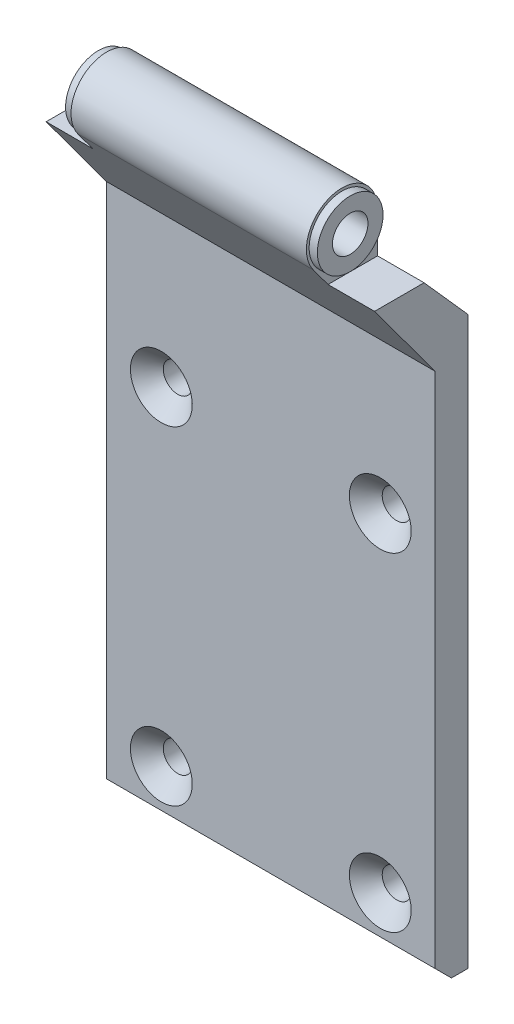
ISO-10303-21;
HEADER;
FILE_DESCRIPTION(('STEP AP214'),'2;1');
FILE_NAME('part.step','',(''),(''),'','','');
FILE_SCHEMA(('AUTOMOTIVE_DESIGN { 1 0 10303 214 1 1 1 1 }'));
ENDSEC;
DATA;
#1=APPLICATION_CONTEXT('core data for automotive mechanical design processes');
#2=APPLICATION_PROTOCOL_DEFINITION('international standard','automotive_design',2000,#1);
#3=PRODUCT_CONTEXT('',#1,'mechanical');
#4=PRODUCT('Part','Part','',(#3));
#5=PRODUCT_RELATED_PRODUCT_CATEGORY('part','',(#4));
#6=PRODUCT_DEFINITION_FORMATION('','',#4);
#7=PRODUCT_DEFINITION_CONTEXT('part definition',#1,'design');
#8=PRODUCT_DEFINITION('design','',#6,#7);
#9=PRODUCT_DEFINITION_SHAPE('','',#8);
#10=(LENGTH_UNIT() NAMED_UNIT(*) SI_UNIT(.MILLI.,.METRE.));
#11=(NAMED_UNIT(*) PLANE_ANGLE_UNIT() SI_UNIT($,.RADIAN.));
#12=(NAMED_UNIT(*) SI_UNIT($,.STERADIAN.) SOLID_ANGLE_UNIT());
#13=UNCERTAINTY_MEASURE_WITH_UNIT(LENGTH_MEASURE(1.E-05),#10,'distance_accuracy_value','');
#14=(GEOMETRIC_REPRESENTATION_CONTEXT(3) GLOBAL_UNCERTAINTY_ASSIGNED_CONTEXT((#13)) GLOBAL_UNIT_ASSIGNED_CONTEXT((#10,
#11,#12)) REPRESENTATION_CONTEXT('',''));
#15=CARTESIAN_POINT('',(0.,0.,0.));
#16=DIRECTION('',(0.,0.,1.));
#17=DIRECTION('',(1.,0.,0.));
#18=AXIS2_PLACEMENT_3D('',#15,#16,#17);
#19=CARTESIAN_POINT('',(41.5,102.5,21.));
#20=DIRECTION('',(-1.,0.,0.));
#21=DIRECTION('',(0.,-1.,0.));
#22=AXIS2_PLACEMENT_3D('',#19,#20,#21);
#23=PLANE('',#22);
#24=CARTESIAN_POINT('',(41.5,110.,14.5));
#25=DIRECTION('',(-1.,0.,0.));
#26=DIRECTION('',(0.,-1.,0.));
#27=AXIS2_PLACEMENT_3D('',#24,#25,#26);
#28=CIRCLE('',#27,6.5);
#29=CARTESIAN_POINT('',(41.5,106.145111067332,19.7335295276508));
#30=VERTEX_POINT('',#29);
#31=CARTESIAN_POINT('',(41.5,110.,8.));
#32=VERTEX_POINT('',#31);
#33=EDGE_CURVE('E293',#30,#32,#28,.T.);
#34=ORIENTED_EDGE('',*,*,#33,.F.);
#35=DIRECTION('',(0.,0.805158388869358,0.593059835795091));
#36=VECTOR('',#35,1.);
#37=CARTESIAN_POINT('',(41.5,87.5,6.));
#38=LINE('',#37,#36);
#39=CARTESIAN_POINT('',(41.5,102.5,17.0486305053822));
#40=VERTEX_POINT('',#39);
#41=EDGE_CURVE('E177',#40,#30,#38,.T.);
#42=ORIENTED_EDGE('',*,*,#41,.F.);
#43=DIRECTION('',(0.,0.,-1.));
#44=VECTOR('',#43,1.);
#45=CARTESIAN_POINT('',(41.5,102.5,21.));
#46=LINE('',#45,#44);
#47=CARTESIAN_POINT('',(41.5,102.5,8.));
#48=VERTEX_POINT('',#47);
#49=EDGE_CURVE('E107',#40,#48,#46,.T.);
#50=ORIENTED_EDGE('',*,*,#49,.T.);
#51=DIRECTION('',(0.,1.,0.));
#52=VECTOR('',#51,1.);
#53=CARTESIAN_POINT('',(41.5,102.5,8.));
#54=LINE('',#53,#52);
#55=EDGE_CURVE('E108',#48,#32,#54,.T.);
#56=ORIENTED_EDGE('',*,*,#55,.T.);
#57=EDGE_LOOP('',(#34,#42,#50,#56));
#58=FACE_BOUND('',#57,.T.);
#59=CARTESIAN_POINT('',(41.5,110.,14.5));
#60=DIRECTION('',(-1.,0.,0.));
#61=DIRECTION('',(0.,-1.,0.));
#62=AXIS2_PLACEMENT_3D('',#59,#60,#61);
#63=CIRCLE('',#62,6.);
#64=CARTESIAN_POINT('',(41.5,104.,14.5));
#65=VERTEX_POINT('',#64);
#66=EDGE_CURVE('E183',#65,#65,#63,.F.);
#67=ORIENTED_EDGE('',*,*,#66,.F.);
#68=EDGE_LOOP('',(#67));
#69=FACE_BOUND('',#68,.T.);
#70=ADVANCED_FACE('F14',(#58,#69),#23,.F.);
#71=CARTESIAN_POINT('',(-1.5,116.5,21.));
#72=DIRECTION('',(1.,0.,0.));
#73=DIRECTION('',(0.,1.,0.));
#74=AXIS2_PLACEMENT_3D('',#71,#72,#73);
#75=PLANE('',#74);
#76=DIRECTION('',(0.,-1.,0.));
#77=VECTOR('',#76,1.);
#78=CARTESIAN_POINT('',(-1.5,116.5,8.));
#79=LINE('',#78,#77);
#80=CARTESIAN_POINT('',(-1.5,110.,8.));
#81=VERTEX_POINT('',#80);
#82=CARTESIAN_POINT('',(-1.5,102.5,8.));
#83=VERTEX_POINT('',#82);
#84=EDGE_CURVE('E291',#81,#83,#79,.T.);
#85=ORIENTED_EDGE('',*,*,#84,.T.);
#86=DIRECTION('',(0.,0.,-1.));
#87=VECTOR('',#86,1.);
#88=CARTESIAN_POINT('',(-1.5,102.5,21.));
#89=LINE('',#88,#87);
#90=CARTESIAN_POINT('',(-1.5,102.5,17.0486305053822));
#91=VERTEX_POINT('',#90);
#92=EDGE_CURVE('E305',#91,#83,#89,.T.);
#93=ORIENTED_EDGE('',*,*,#92,.F.);
#94=DIRECTION('',(0.,-0.805158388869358,-0.593059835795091));
#95=VECTOR('',#94,1.);
#96=CARTESIAN_POINT('',(-1.5,87.5,6.));
#97=LINE('',#96,#95);
#98=CARTESIAN_POINT('',(-1.5,106.145111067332,19.7335295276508));
#99=VERTEX_POINT('',#98);
#100=EDGE_CURVE('E174',#99,#91,#97,.T.);
#101=ORIENTED_EDGE('',*,*,#100,.F.);
#102=CARTESIAN_POINT('',(-1.5,110.,14.5));
#103=DIRECTION('',(1.,0.,0.));
#104=DIRECTION('',(0.,1.,0.));
#105=AXIS2_PLACEMENT_3D('',#102,#103,#104);
#106=CIRCLE('',#105,6.5);
#107=EDGE_CURVE('E125',#81,#99,#106,.T.);
#108=ORIENTED_EDGE('',*,*,#107,.F.);
#109=EDGE_LOOP('',(#85,#93,#101,#108));
#110=FACE_BOUND('',#109,.T.);
#111=CARTESIAN_POINT('',(-1.5,110.,14.5));
#112=DIRECTION('',(1.,0.,0.));
#113=DIRECTION('',(0.,1.,0.));
#114=AXIS2_PLACEMENT_3D('',#111,#112,#113);
#115=CIRCLE('',#114,6.);
#116=CARTESIAN_POINT('',(-1.5,116.,14.5));
#117=VERTEX_POINT('',#116);
#118=EDGE_CURVE('E180',#117,#117,#115,.F.);
#119=ORIENTED_EDGE('',*,*,#118,.F.);
#120=EDGE_LOOP('',(#119));
#121=FACE_BOUND('',#120,.T.);
#122=ADVANCED_FACE('F233',(#110,#121),#75,.F.);
#123=CARTESIAN_POINT('',(-10.,110.,14.5));
#124=DIRECTION('',(1.,0.,0.));
#125=DIRECTION('',(0.,1.,0.));
#126=AXIS2_PLACEMENT_3D('',#123,#124,#125);
#127=CYLINDRICAL_SURFACE('',#126,6.5);
#128=DIRECTION('',(1.,0.,0.));
#129=VECTOR('',#128,1.);
#130=CARTESIAN_POINT('',(-10.,106.145111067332,19.7335295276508));
#131=LINE('',#130,#129);
#132=EDGE_CURVE('E151',#99,#30,#131,.T.);
#133=ORIENTED_EDGE('',*,*,#132,.T.);
#134=ORIENTED_EDGE('',*,*,#33,.T.);
#135=DIRECTION('',(1.,0.,0.));
#136=VECTOR('',#135,1.);
#137=CARTESIAN_POINT('',(-10.,110.,8.));
#138=LINE('',#137,#136);
#139=EDGE_CURVE('E163',#81,#32,#138,.T.);
#140=ORIENTED_EDGE('',*,*,#139,.F.);
#141=ORIENTED_EDGE('',*,*,#107,.T.);
#142=EDGE_LOOP('',(#133,#134,#140,#141));
#143=FACE_BOUND('',#142,.T.);
#144=ADVANCED_FACE('F240',(#143),#127,.T.);
#145=CARTESIAN_POINT('',(-10.,110.,8.));
#146=DIRECTION('',(0.,0.,1.));
#147=DIRECTION('',(0.,1.,0.));
#148=AXIS2_PLACEMENT_3D('',#145,#146,#147);
#149=PLANE('',#148);
#150=ORIENTED_EDGE('',*,*,#139,.T.);
#151=ORIENTED_EDGE('',*,*,#55,.F.);
#152=DIRECTION('',(1.,0.,0.));
#153=VECTOR('',#152,1.);
#154=CARTESIAN_POINT('',(-10.,102.5,8.));
#155=LINE('',#154,#153);
#156=EDGE_CURVE('E118',#83,#48,#155,.T.);
#157=ORIENTED_EDGE('',*,*,#156,.F.);
#158=ORIENTED_EDGE('',*,*,#84,.F.);
#159=EDGE_LOOP('',(#150,#151,#157,#158));
#160=FACE_BOUND('',#159,.T.);
#161=ADVANCED_FACE('F16',(#160),#149,.F.);
#162=CARTESIAN_POINT('',(-10.,102.5,8.));
#163=DIRECTION('',(0.,-0.66436383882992,0.74740931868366));
#164=DIRECTION('',(0.,0.74740931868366,0.66436383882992));
#165=AXIS2_PLACEMENT_3D('',#162,#163,#164);
#166=PLANE('',#165);
#167=DIRECTION('',(1.,0.,0.));
#168=VECTOR('',#167,1.);
#169=CARTESIAN_POINT('',(-10.,93.5,0.));
#170=LINE('',#169,#168);
#171=CARTESIAN_POINT('',(-10.,93.5,0.));
#172=VERTEX_POINT('',#171);
#173=CARTESIAN_POINT('',(50.,93.5,0.));
#174=VERTEX_POINT('',#173);
#175=EDGE_CURVE('E159',#172,#174,#170,.T.);
#176=ORIENTED_EDGE('',*,*,#175,.F.);
#177=DIRECTION('',(0.,-0.74740931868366,-0.66436383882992));
#178=VECTOR('',#177,1.);
#179=CARTESIAN_POINT('',(-10.,102.5,8.));
#180=LINE('',#179,#178);
#181=CARTESIAN_POINT('',(-10.,102.5,8.));
#182=VERTEX_POINT('',#181);
#183=EDGE_CURVE('E138',#182,#172,#180,.T.);
#184=ORIENTED_EDGE('',*,*,#183,.F.);
#185=EDGE_CURVE('E161',#182,#83,#155,.T.);
#186=ORIENTED_EDGE('',*,*,#185,.T.);
#187=ORIENTED_EDGE('',*,*,#156,.T.);
#188=DIRECTION('',(-1.,0.,0.));
#189=VECTOR('',#188,1.);
#190=CARTESIAN_POINT('',(50.,102.5,8.));
#191=LINE('',#190,#189);
#192=CARTESIAN_POINT('',(50.,102.5,8.));
#193=VERTEX_POINT('',#192);
#194=EDGE_CURVE('E101',#193,#48,#191,.T.);
#195=ORIENTED_EDGE('',*,*,#194,.F.);
#196=DIRECTION('',(0.,-0.74740931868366,-0.66436383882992));
#197=VECTOR('',#196,1.);
#198=CARTESIAN_POINT('',(50.,102.5,8.));
#199=LINE('',#198,#197);
#200=EDGE_CURVE('E114',#193,#174,#199,.T.);
#201=ORIENTED_EDGE('',*,*,#200,.T.);
#202=EDGE_LOOP('',(#176,#184,#186,#187,#195,#201));
#203=FACE_BOUND('',#202,.T.);
#204=ADVANCED_FACE('F113',(#203),#166,.F.);
#205=CARTESIAN_POINT('',(-10.,93.5,0.));
#206=DIRECTION('',(0.,0.,1.));
#207=DIRECTION('',(-1.,0.,0.));
#208=AXIS2_PLACEMENT_3D('',#205,#206,#207);
#209=PLANE('',#208);
#210=CARTESIAN_POINT('',(40.,60.,0.));
#211=DIRECTION('',(0.,0.,1.));
#212=DIRECTION('',(0.,1.,0.));
#213=AXIS2_PLACEMENT_3D('',#210,#211,#212);
#214=CIRCLE('',#213,2.65);
#215=CARTESIAN_POINT('',(40.,62.65,0.));
#216=VERTEX_POINT('',#215);
#217=EDGE_CURVE('E376',#216,#216,#214,.T.);
#218=ORIENTED_EDGE('',*,*,#217,.T.);
#219=EDGE_LOOP('',(#218));
#220=FACE_BOUND('',#219,.T.);
#221=CARTESIAN_POINT('',(40.,0.,0.));
#222=DIRECTION('',(0.,0.,1.));
#223=DIRECTION('',(0.,1.,0.));
#224=AXIS2_PLACEMENT_3D('',#221,#222,#223);
#225=CIRCLE('',#224,2.65);
#226=CARTESIAN_POINT('',(40.,2.65,0.));
#227=VERTEX_POINT('',#226);
#228=EDGE_CURVE('E377',#227,#227,#225,.T.);
#229=ORIENTED_EDGE('',*,*,#228,.T.);
#230=EDGE_LOOP('',(#229));
#231=FACE_BOUND('',#230,.T.);
#232=CARTESIAN_POINT('',(0.,60.,0.));
#233=DIRECTION('',(0.,0.,1.));
#234=DIRECTION('',(0.,1.,0.));
#235=AXIS2_PLACEMENT_3D('',#232,#233,#234);
#236=CIRCLE('',#235,2.65);
#237=CARTESIAN_POINT('',(0.,62.65,0.));
#238=VERTEX_POINT('',#237);
#239=EDGE_CURVE('E380',#238,#238,#236,.T.);
#240=ORIENTED_EDGE('',*,*,#239,.T.);
#241=EDGE_LOOP('',(#240));
#242=FACE_BOUND('',#241,.T.);
#243=CARTESIAN_POINT('',(0.,0.,0.));
#244=DIRECTION('',(0.,0.,1.));
#245=DIRECTION('',(0.,1.,0.));
#246=AXIS2_PLACEMENT_3D('',#243,#244,#245);
#247=CIRCLE('',#246,2.65);
#248=CARTESIAN_POINT('',(0.,2.65,0.));
#249=VERTEX_POINT('',#248);
#250=EDGE_CURVE('E385',#249,#249,#247,.T.);
#251=ORIENTED_EDGE('',*,*,#250,.T.);
#252=EDGE_LOOP('',(#251));
#253=FACE_BOUND('',#252,.T.);
#254=DIRECTION('',(1.,0.,0.));
#255=VECTOR('',#254,1.);
#256=CARTESIAN_POINT('',(-10.,-10.,0.));
#257=LINE('',#256,#255);
#258=CARTESIAN_POINT('',(-10.,-10.,0.));
#259=VERTEX_POINT('',#258);
#260=CARTESIAN_POINT('',(50.,-10.,0.));
#261=VERTEX_POINT('',#260);
#262=EDGE_CURVE('E157',#259,#261,#257,.T.);
#263=ORIENTED_EDGE('',*,*,#262,.F.);
#264=DIRECTION('',(0.,-1.,0.));
#265=VECTOR('',#264,1.);
#266=CARTESIAN_POINT('',(-10.,93.5,0.));
#267=LINE('',#266,#265);
#268=EDGE_CURVE('E141',#172,#259,#267,.T.);
#269=ORIENTED_EDGE('',*,*,#268,.F.);
#270=ORIENTED_EDGE('',*,*,#175,.T.);
#271=DIRECTION('',(0.,-1.,0.));
#272=VECTOR('',#271,1.);
#273=CARTESIAN_POINT('',(50.,93.5,0.));
#274=LINE('',#273,#272);
#275=EDGE_CURVE('E124',#174,#261,#274,.T.);
#276=ORIENTED_EDGE('',*,*,#275,.T.);
#277=EDGE_LOOP('',(#263,#269,#270,#276));
#278=FACE_BOUND('',#277,.T.);
#279=ADVANCED_FACE('F275',(#220,#231,#242,#253,#278),#209,.F.);
#280=CARTESIAN_POINT('',(-10.,-10.,0.));
#281=DIRECTION('',(0.,1.,0.));
#282=DIRECTION('',(-1.,0.,0.));
#283=AXIS2_PLACEMENT_3D('',#280,#281,#282);
#284=PLANE('',#283);
#285=DIRECTION('',(0.,0.,1.));
#286=VECTOR('',#285,1.);
#287=CARTESIAN_POINT('',(50.,-10.,0.));
#288=LINE('',#287,#286);
#289=CARTESIAN_POINT('',(50.,-10.,3.));
#290=VERTEX_POINT('',#289);
#291=EDGE_CURVE('E127',#261,#290,#288,.T.);
#292=ORIENTED_EDGE('',*,*,#291,.T.);
#293=DIRECTION('',(-1.,0.,0.));
#294=VECTOR('',#293,1.);
#295=CARTESIAN_POINT('',(-10.,-10.,3.));
#296=LINE('',#295,#294);
#297=CARTESIAN_POINT('',(-10.,-10.,3.));
#298=VERTEX_POINT('',#297);
#299=EDGE_CURVE('E37',#290,#298,#296,.T.);
#300=ORIENTED_EDGE('',*,*,#299,.T.);
#301=DIRECTION('',(0.,0.,1.));
#302=VECTOR('',#301,1.);
#303=CARTESIAN_POINT('',(-10.,-10.,0.));
#304=LINE('',#303,#302);
#305=EDGE_CURVE('E144',#259,#298,#304,.T.);
#306=ORIENTED_EDGE('',*,*,#305,.F.);
#307=ORIENTED_EDGE('',*,*,#262,.T.);
#308=EDGE_LOOP('',(#292,#300,#306,#307));
#309=FACE_BOUND('',#308,.T.);
#310=ADVANCED_FACE('F271',(#309),#284,.F.);
#311=CARTESIAN_POINT('',(-10.,-10.,6.));
#312=DIRECTION('',(0.,0.,-1.));
#313=DIRECTION('',(0.,-1.,0.));
#314=AXIS2_PLACEMENT_3D('',#311,#312,#313);
#315=PLANE('',#314);
#316=CARTESIAN_POINT('',(40.,60.,6.));
#317=DIRECTION('',(0.,0.,-1.));
#318=DIRECTION('',(0.,-1.,0.));
#319=AXIS2_PLACEMENT_3D('',#316,#317,#318);
#320=CIRCLE('',#319,5.65);
#321=CARTESIAN_POINT('',(40.,54.35,6.));
#322=VERTEX_POINT('',#321);
#323=EDGE_CURVE('E203',#322,#322,#320,.T.);
#324=ORIENTED_EDGE('',*,*,#323,.T.);
#325=EDGE_LOOP('',(#324));
#326=FACE_BOUND('',#325,.T.);
#327=CARTESIAN_POINT('',(0.,60.,6.));
#328=DIRECTION('',(0.,0.,-1.));
#329=DIRECTION('',(0.,-1.,0.));
#330=AXIS2_PLACEMENT_3D('',#327,#328,#329);
#331=CIRCLE('',#330,5.65);
#332=CARTESIAN_POINT('',(0.,54.35,6.));
#333=VERTEX_POINT('',#332);
#334=EDGE_CURVE('E200',#333,#333,#331,.T.);
#335=ORIENTED_EDGE('',*,*,#334,.T.);
#336=EDGE_LOOP('',(#335));
#337=FACE_BOUND('',#336,.T.);
#338=CARTESIAN_POINT('',(0.,0.,6.));
#339=DIRECTION('',(0.,0.,-1.));
#340=DIRECTION('',(0.,-1.,0.));
#341=AXIS2_PLACEMENT_3D('',#338,#339,#340);
#342=CIRCLE('',#341,5.65);
#343=CARTESIAN_POINT('',(0.,-5.65,6.));
#344=VERTEX_POINT('',#343);
#345=EDGE_CURVE('E197',#344,#344,#342,.T.);
#346=ORIENTED_EDGE('',*,*,#345,.T.);
#347=EDGE_LOOP('',(#346));
#348=FACE_BOUND('',#347,.T.);
#349=CARTESIAN_POINT('',(40.,0.,6.));
#350=DIRECTION('',(0.,0.,-1.));
#351=DIRECTION('',(0.,-1.,0.));
#352=AXIS2_PLACEMENT_3D('',#349,#350,#351);
#353=CIRCLE('',#352,5.65);
#354=CARTESIAN_POINT('',(40.,-5.65,6.));
#355=VERTEX_POINT('',#354);
#356=EDGE_CURVE('E194',#355,#355,#353,.T.);
#357=ORIENTED_EDGE('',*,*,#356,.T.);
#358=EDGE_LOOP('',(#357));
#359=FACE_BOUND('',#358,.T.);
#360=DIRECTION('',(0.,1.,0.));
#361=VECTOR('',#360,1.);
#362=CARTESIAN_POINT('',(-10.,-10.,6.));
#363=LINE('',#362,#361);
#364=CARTESIAN_POINT('',(-10.,-7.,6.));
#365=VERTEX_POINT('',#364);
#366=CARTESIAN_POINT('',(-10.,87.5,6.));
#367=VERTEX_POINT('',#366);
#368=EDGE_CURVE('E146',#365,#367,#363,.T.);
#369=ORIENTED_EDGE('',*,*,#368,.F.);
#370=DIRECTION('',(1.,0.,0.));
#371=VECTOR('',#370,1.);
#372=CARTESIAN_POINT('',(-10.,-7.,6.));
#373=LINE('',#372,#371);
#374=CARTESIAN_POINT('',(50.,-7.,6.));
#375=VERTEX_POINT('',#374);
#376=EDGE_CURVE('E166',#365,#375,#373,.T.);
#377=ORIENTED_EDGE('',*,*,#376,.T.);
#378=DIRECTION('',(0.,1.,0.));
#379=VECTOR('',#378,1.);
#380=CARTESIAN_POINT('',(50.,-10.,6.));
#381=LINE('',#380,#379);
#382=CARTESIAN_POINT('',(50.,87.5,6.));
#383=VERTEX_POINT('',#382);
#384=EDGE_CURVE('E134',#375,#383,#381,.T.);
#385=ORIENTED_EDGE('',*,*,#384,.T.);
#386=DIRECTION('',(1.,0.,0.));
#387=VECTOR('',#386,1.);
#388=CARTESIAN_POINT('',(-10.,87.5,6.));
#389=LINE('',#388,#387);
#390=EDGE_CURVE('E154',#367,#383,#389,.T.);
#391=ORIENTED_EDGE('',*,*,#390,.F.);
#392=EDGE_LOOP('',(#369,#377,#385,#391));
#393=FACE_BOUND('',#392,.T.);
#394=ADVANCED_FACE('F262',(#326,#337,#348,#359,#393),#315,.F.);
#395=CARTESIAN_POINT('',(-10.,87.5,6.));
#396=DIRECTION('',(0.,0.593059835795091,-0.805158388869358));
#397=DIRECTION('',(0.,-0.805158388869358,-0.593059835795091));
#398=AXIS2_PLACEMENT_3D('',#395,#396,#397);
#399=PLANE('',#398);
#400=DIRECTION('',(-1.,0.,0.));
#401=VECTOR('',#400,1.);
#402=CARTESIAN_POINT('',(-10.,102.5,17.0486305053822));
#403=LINE('',#402,#401);
#404=CARTESIAN_POINT('',(50.,102.5,17.0486305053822));
#405=VERTEX_POINT('',#404);
#406=EDGE_CURVE('E29',#405,#40,#403,.T.);
#407=ORIENTED_EDGE('',*,*,#406,.T.);
#408=ORIENTED_EDGE('',*,*,#41,.T.);
#409=ORIENTED_EDGE('',*,*,#132,.F.);
#410=ORIENTED_EDGE('',*,*,#100,.T.);
#411=DIRECTION('',(-1.,0.,0.));
#412=VECTOR('',#411,1.);
#413=CARTESIAN_POINT('',(-10.,102.5,17.0486305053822));
#414=LINE('',#413,#412);
#415=CARTESIAN_POINT('',(-10.,102.5,17.0486305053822));
#416=VERTEX_POINT('',#415);
#417=EDGE_CURVE('E129',#91,#416,#414,.T.);
#418=ORIENTED_EDGE('',*,*,#417,.T.);
#419=DIRECTION('',(0.,0.805158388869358,0.593059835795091));
#420=VECTOR('',#419,1.);
#421=CARTESIAN_POINT('',(-10.,87.5,6.));
#422=LINE('',#421,#420);
#423=EDGE_CURVE('E148',#367,#416,#422,.T.);
#424=ORIENTED_EDGE('',*,*,#423,.F.);
#425=ORIENTED_EDGE('',*,*,#390,.T.);
#426=DIRECTION('',(0.,0.805158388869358,0.593059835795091));
#427=VECTOR('',#426,1.);
#428=CARTESIAN_POINT('',(50.,87.5,6.));
#429=LINE('',#428,#427);
#430=EDGE_CURVE('E136',#383,#405,#429,.T.);
#431=ORIENTED_EDGE('',*,*,#430,.T.);
#432=EDGE_LOOP('',(#407,#408,#409,#410,#418,#424,#425,#431));
#433=FACE_BOUND('',#432,.T.);
#434=ADVANCED_FACE('F258',(#433),#399,.F.);
#435=CARTESIAN_POINT('',(-10.,110.,14.5));
#436=DIRECTION('',(-1.,0.,0.));
#437=DIRECTION('',(0.,-1.,0.));
#438=AXIS2_PLACEMENT_3D('',#435,#436,#437);
#439=PLANE('',#438);
#440=DIRECTION('',(0.,0.,-1.));
#441=VECTOR('',#440,1.);
#442=CARTESIAN_POINT('',(-10.,102.5,21.));
#443=LINE('',#442,#441);
#444=EDGE_CURVE('E302',#416,#182,#443,.T.);
#445=ORIENTED_EDGE('',*,*,#444,.T.);
#446=ORIENTED_EDGE('',*,*,#183,.T.);
#447=ORIENTED_EDGE('',*,*,#268,.T.);
#448=ORIENTED_EDGE('',*,*,#305,.T.);
#449=DIRECTION('',(0.,-0.707106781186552,-0.707106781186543));
#450=VECTOR('',#449,1.);
#451=CARTESIAN_POINT('',(-10.,55.7500000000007,68.75));
#452=LINE('',#451,#450);
#453=EDGE_CURVE('E172',#298,#365,#452,.F.);
#454=ORIENTED_EDGE('',*,*,#453,.T.);
#455=ORIENTED_EDGE('',*,*,#368,.T.);
#456=ORIENTED_EDGE('',*,*,#423,.T.);
#457=EDGE_LOOP('',(#445,#446,#447,#448,#454,#455,#456));
#458=FACE_BOUND('',#457,.T.);
#459=ADVANCED_FACE('F257',(#458),#439,.T.);
#460=CARTESIAN_POINT('',(50.,110.,14.5));
#461=DIRECTION('',(-1.,0.,0.));
#462=DIRECTION('',(0.,-1.,0.));
#463=AXIS2_PLACEMENT_3D('',#460,#461,#462);
#464=PLANE('',#463);
#465=ORIENTED_EDGE('',*,*,#200,.F.);
#466=DIRECTION('',(0.,0.,-1.));
#467=VECTOR('',#466,1.);
#468=CARTESIAN_POINT('',(50.,102.5,21.));
#469=LINE('',#468,#467);
#470=EDGE_CURVE('E98',#405,#193,#469,.T.);
#471=ORIENTED_EDGE('',*,*,#470,.F.);
#472=ORIENTED_EDGE('',*,*,#430,.F.);
#473=ORIENTED_EDGE('',*,*,#384,.F.);
#474=DIRECTION('',(0.,0.707106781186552,0.707106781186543));
#475=VECTOR('',#474,1.);
#476=CARTESIAN_POINT('',(50.,-7.,6.));
#477=LINE('',#476,#475);
#478=EDGE_CURVE('E169',#375,#290,#477,.F.);
#479=ORIENTED_EDGE('',*,*,#478,.T.);
#480=ORIENTED_EDGE('',*,*,#291,.F.);
#481=ORIENTED_EDGE('',*,*,#275,.F.);
#482=EDGE_LOOP('',(#465,#471,#472,#473,#479,#480,#481));
#483=FACE_BOUND('',#482,.T.);
#484=ADVANCED_FACE('F121',(#483),#464,.F.);
#485=CARTESIAN_POINT('',(-10.,-7.,6.));
#486=DIRECTION('',(0.,0.707106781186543,-0.707106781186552));
#487=DIRECTION('',(0.,-0.707106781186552,-0.707106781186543));
#488=AXIS2_PLACEMENT_3D('',#485,#486,#487);
#489=PLANE('',#488);
#490=ORIENTED_EDGE('',*,*,#453,.F.);
#491=ORIENTED_EDGE('',*,*,#299,.F.);
#492=ORIENTED_EDGE('',*,*,#478,.F.);
#493=ORIENTED_EDGE('',*,*,#376,.F.);
#494=EDGE_LOOP('',(#490,#491,#492,#493));
#495=FACE_BOUND('',#494,.T.);
#496=ADVANCED_FACE('F249',(#495),#489,.F.);
#497=CARTESIAN_POINT('',(-1.5,102.5,21.));
#498=DIRECTION('',(0.,-1.,0.));
#499=DIRECTION('',(0.,0.,1.));
#500=AXIS2_PLACEMENT_3D('',#497,#498,#499);
#501=PLANE('',#500);
#502=ORIENTED_EDGE('',*,*,#92,.T.);
#503=ORIENTED_EDGE('',*,*,#185,.F.);
#504=ORIENTED_EDGE('',*,*,#444,.F.);
#505=ORIENTED_EDGE('',*,*,#417,.F.);
#506=EDGE_LOOP('',(#502,#503,#504,#505));
#507=FACE_BOUND('',#506,.T.);
#508=ADVANCED_FACE('F247',(#507),#501,.F.);
#509=CARTESIAN_POINT('',(50.,102.5,21.));
#510=DIRECTION('',(0.,-1.,0.));
#511=DIRECTION('',(0.,0.,1.));
#512=AXIS2_PLACEMENT_3D('',#509,#510,#511);
#513=PLANE('',#512);
#514=ORIENTED_EDGE('',*,*,#470,.T.);
#515=ORIENTED_EDGE('',*,*,#194,.T.);
#516=ORIENTED_EDGE('',*,*,#49,.F.);
#517=ORIENTED_EDGE('',*,*,#406,.F.);
#518=EDGE_LOOP('',(#514,#515,#516,#517));
#519=FACE_BOUND('',#518,.T.);
#520=ADVANCED_FACE('F100',(#519),#513,.F.);
#521=CARTESIAN_POINT('',(-3.,110.,14.5));
#522=DIRECTION('',(1.,0.,0.));
#523=DIRECTION('',(0.,1.,0.));
#524=AXIS2_PLACEMENT_3D('',#521,#522,#523);
#525=CYLINDRICAL_SURFACE('',#524,6.);
#526=CARTESIAN_POINT('',(-3.,110.,14.5));
#527=DIRECTION('',(-1.,0.,0.));
#528=DIRECTION('',(0.,-1.,0.));
#529=AXIS2_PLACEMENT_3D('',#526,#527,#528);
#530=CIRCLE('',#529,6.);
#531=CARTESIAN_POINT('',(-3.,104.,14.5));
#532=VERTEX_POINT('',#531);
#533=EDGE_CURVE('E119',#532,#532,#530,.T.);
#534=ORIENTED_EDGE('',*,*,#533,.F.);
#535=EDGE_LOOP('',(#534));
#536=FACE_BOUND('',#535,.T.);
#537=ORIENTED_EDGE('',*,*,#118,.T.);
#538=EDGE_LOOP('',(#537));
#539=FACE_BOUND('',#538,.T.);
#540=ADVANCED_FACE('F321',(#536,#539),#525,.T.);
#541=CARTESIAN_POINT('',(-3.,110.,14.5));
#542=DIRECTION('',(-1.,0.,0.));
#543=DIRECTION('',(0.,-1.,0.));
#544=AXIS2_PLACEMENT_3D('',#541,#542,#543);
#545=PLANE('',#544);
#546=CARTESIAN_POINT('',(-3.,110.,14.5));
#547=DIRECTION('',(-1.,0.,0.));
#548=DIRECTION('',(0.,-1.,0.));
#549=AXIS2_PLACEMENT_3D('',#546,#547,#548);
#550=CIRCLE('',#549,3.25);
#551=CARTESIAN_POINT('',(-3.,106.75,14.5));
#552=VERTEX_POINT('',#551);
#553=EDGE_CURVE('E191',#552,#552,#550,.T.);
#554=ORIENTED_EDGE('',*,*,#553,.F.);
#555=EDGE_LOOP('',(#554));
#556=FACE_BOUND('',#555,.T.);
#557=ORIENTED_EDGE('',*,*,#533,.T.);
#558=EDGE_LOOP('',(#557));
#559=FACE_BOUND('',#558,.T.);
#560=ADVANCED_FACE('F323',(#556,#559),#545,.T.);
#561=CARTESIAN_POINT('',(43.,110.,14.5));
#562=DIRECTION('',(-1.,0.,0.));
#563=DIRECTION('',(0.,-1.,0.));
#564=AXIS2_PLACEMENT_3D('',#561,#562,#563);
#565=CYLINDRICAL_SURFACE('',#564,6.);
#566=CARTESIAN_POINT('',(43.,110.,14.5));
#567=DIRECTION('',(1.,0.,0.));
#568=DIRECTION('',(0.,1.,0.));
#569=AXIS2_PLACEMENT_3D('',#566,#567,#568);
#570=CIRCLE('',#569,6.);
#571=CARTESIAN_POINT('',(43.,116.,14.5));
#572=VERTEX_POINT('',#571);
#573=EDGE_CURVE('E190',#572,#572,#570,.T.);
#574=ORIENTED_EDGE('',*,*,#573,.F.);
#575=EDGE_LOOP('',(#574));
#576=FACE_BOUND('',#575,.T.);
#577=ORIENTED_EDGE('',*,*,#66,.T.);
#578=EDGE_LOOP('',(#577));
#579=FACE_BOUND('',#578,.T.);
#580=ADVANCED_FACE('F331',(#576,#579),#565,.T.);
#581=CARTESIAN_POINT('',(43.,110.,14.5));
#582=DIRECTION('',(1.,0.,0.));
#583=DIRECTION('',(0.,1.,0.));
#584=AXIS2_PLACEMENT_3D('',#581,#582,#583);
#585=PLANE('',#584);
#586=CARTESIAN_POINT('',(43.,110.,14.5));
#587=DIRECTION('',(1.,0.,0.));
#588=DIRECTION('',(0.,1.,0.));
#589=AXIS2_PLACEMENT_3D('',#586,#587,#588);
#590=CIRCLE('',#589,3.25);
#591=CARTESIAN_POINT('',(43.,113.25,14.5));
#592=VERTEX_POINT('',#591);
#593=EDGE_CURVE('E187',#592,#592,#590,.T.);
#594=ORIENTED_EDGE('',*,*,#593,.F.);
#595=EDGE_LOOP('',(#594));
#596=FACE_BOUND('',#595,.T.);
#597=ORIENTED_EDGE('',*,*,#573,.T.);
#598=EDGE_LOOP('',(#597));
#599=FACE_BOUND('',#598,.T.);
#600=ADVANCED_FACE('F325',(#596,#599),#585,.T.);
#601=CARTESIAN_POINT('',(50.,110.,14.5));
#602=DIRECTION('',(-1.,0.,0.));
#603=DIRECTION('',(0.,-1.,0.));
#604=AXIS2_PLACEMENT_3D('',#601,#602,#603);
#605=CYLINDRICAL_SURFACE('',#604,3.25);
#606=ORIENTED_EDGE('',*,*,#593,.T.);
#607=EDGE_LOOP('',(#606));
#608=FACE_BOUND('',#607,.T.);
#609=ORIENTED_EDGE('',*,*,#553,.T.);
#610=EDGE_LOOP('',(#609));
#611=FACE_BOUND('',#610,.T.);
#612=ADVANCED_FACE('F336',(#608,#611),#605,.F.);
#613=CARTESIAN_POINT('',(0.,0.,0.));
#614=DIRECTION('',(0.,0.,1.));
#615=DIRECTION('',(0.,1.,0.));
#616=AXIS2_PLACEMENT_3D('',#613,#614,#615);
#617=CYLINDRICAL_SURFACE('',#616,2.65);
#618=CARTESIAN_POINT('',(0.,0.,3.));
#619=DIRECTION('',(0.,0.,-1.));
#620=DIRECTION('',(1.,0.,0.));
#621=AXIS2_PLACEMENT_3D('',#618,#619,#620);
#622=CIRCLE('',#621,2.65);
#623=CARTESIAN_POINT('',(2.65,0.,3.));
#624=VERTEX_POINT('',#623);
#625=EDGE_CURVE('E22',#624,#624,#622,.F.);
#626=ORIENTED_EDGE('',*,*,#625,.T.);
#627=EDGE_LOOP('',(#626));
#628=FACE_BOUND('',#627,.T.);
#629=ORIENTED_EDGE('',*,*,#250,.F.);
#630=EDGE_LOOP('',(#629));
#631=FACE_BOUND('',#630,.T.);
#632=ADVANCED_FACE('F211',(#628,#631),#617,.F.);
#633=CARTESIAN_POINT('',(0.,60.,0.));
#634=DIRECTION('',(0.,0.,1.));
#635=DIRECTION('',(0.,1.,0.));
#636=AXIS2_PLACEMENT_3D('',#633,#634,#635);
#637=CYLINDRICAL_SURFACE('',#636,2.65);
#638=CARTESIAN_POINT('',(0.,60.,3.));
#639=DIRECTION('',(0.,0.,-1.));
#640=DIRECTION('',(1.,0.,0.));
#641=AXIS2_PLACEMENT_3D('',#638,#639,#640);
#642=CIRCLE('',#641,2.65);
#643=CARTESIAN_POINT('',(2.65,60.,3.));
#644=VERTEX_POINT('',#643);
#645=EDGE_CURVE('E206',#644,#644,#642,.F.);
#646=ORIENTED_EDGE('',*,*,#645,.T.);
#647=EDGE_LOOP('',(#646));
#648=FACE_BOUND('',#647,.T.);
#649=ORIENTED_EDGE('',*,*,#239,.F.);
#650=EDGE_LOOP('',(#649));
#651=FACE_BOUND('',#650,.T.);
#652=ADVANCED_FACE('F353',(#648,#651),#637,.F.);
#653=CARTESIAN_POINT('',(40.,0.,0.));
#654=DIRECTION('',(0.,0.,1.));
#655=DIRECTION('',(0.,1.,0.));
#656=AXIS2_PLACEMENT_3D('',#653,#654,#655);
#657=CYLINDRICAL_SURFACE('',#656,2.65);
#658=CARTESIAN_POINT('',(40.,0.,3.));
#659=DIRECTION('',(0.,0.,-1.));
#660=DIRECTION('',(1.,0.,0.));
#661=AXIS2_PLACEMENT_3D('',#658,#659,#660);
#662=CIRCLE('',#661,2.65);
#663=CARTESIAN_POINT('',(42.65,0.,3.));
#664=VERTEX_POINT('',#663);
#665=EDGE_CURVE('E9',#664,#664,#662,.F.);
#666=ORIENTED_EDGE('',*,*,#665,.T.);
#667=EDGE_LOOP('',(#666));
#668=FACE_BOUND('',#667,.T.);
#669=ORIENTED_EDGE('',*,*,#228,.F.);
#670=EDGE_LOOP('',(#669));
#671=FACE_BOUND('',#670,.T.);
#672=ADVANCED_FACE('F356',(#668,#671),#657,.F.);
#673=CARTESIAN_POINT('',(40.,60.,0.));
#674=DIRECTION('',(0.,0.,1.));
#675=DIRECTION('',(0.,1.,0.));
#676=AXIS2_PLACEMENT_3D('',#673,#674,#675);
#677=CYLINDRICAL_SURFACE('',#676,2.65);
#678=CARTESIAN_POINT('',(40.,60.,3.));
#679=DIRECTION('',(0.,0.,-1.));
#680=DIRECTION('',(1.,0.,0.));
#681=AXIS2_PLACEMENT_3D('',#678,#679,#680);
#682=CIRCLE('',#681,2.65);
#683=CARTESIAN_POINT('',(42.65,60.,3.));
#684=VERTEX_POINT('',#683);
#685=EDGE_CURVE('E186',#684,#684,#682,.F.);
#686=ORIENTED_EDGE('',*,*,#685,.T.);
#687=EDGE_LOOP('',(#686));
#688=FACE_BOUND('',#687,.T.);
#689=ORIENTED_EDGE('',*,*,#217,.F.);
#690=EDGE_LOOP('',(#689));
#691=FACE_BOUND('',#690,.T.);
#692=ADVANCED_FACE('F360',(#688,#691),#677,.F.);
#693=CARTESIAN_POINT('',(40.,60.,3.));
#694=DIRECTION('',(0.,0.,1.));
#695=DIRECTION('',(-1.,0.,0.));
#696=AXIS2_PLACEMENT_3D('',#693,#694,#695);
#697=CONICAL_SURFACE('',#696,2.65,0.785398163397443);
#698=ORIENTED_EDGE('',*,*,#323,.F.);
#699=EDGE_LOOP('',(#698));
#700=FACE_BOUND('',#699,.T.);
#701=ORIENTED_EDGE('',*,*,#685,.F.);
#702=EDGE_LOOP('',(#701));
#703=FACE_BOUND('',#702,.T.);
#704=ADVANCED_FACE('F228',(#700,#703),#697,.F.);
#705=CARTESIAN_POINT('',(0.,60.,3.));
#706=DIRECTION('',(0.,0.,1.));
#707=DIRECTION('',(-1.,0.,0.));
#708=AXIS2_PLACEMENT_3D('',#705,#706,#707);
#709=CONICAL_SURFACE('',#708,2.65,0.785398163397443);
#710=ORIENTED_EDGE('',*,*,#334,.F.);
#711=EDGE_LOOP('',(#710));
#712=FACE_BOUND('',#711,.T.);
#713=ORIENTED_EDGE('',*,*,#645,.F.);
#714=EDGE_LOOP('',(#713));
#715=FACE_BOUND('',#714,.T.);
#716=ADVANCED_FACE('F217',(#712,#715),#709,.F.);
#717=CARTESIAN_POINT('',(0.,0.,3.));
#718=DIRECTION('',(0.,0.,1.));
#719=DIRECTION('',(-1.,0.,0.));
#720=AXIS2_PLACEMENT_3D('',#717,#718,#719);
#721=CONICAL_SURFACE('',#720,2.65,0.785398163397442);
#722=ORIENTED_EDGE('',*,*,#345,.F.);
#723=EDGE_LOOP('',(#722));
#724=FACE_BOUND('',#723,.T.);
#725=ORIENTED_EDGE('',*,*,#625,.F.);
#726=EDGE_LOOP('',(#725));
#727=FACE_BOUND('',#726,.T.);
#728=ADVANCED_FACE('F214',(#724,#727),#721,.F.);
#729=CARTESIAN_POINT('',(40.,0.,3.));
#730=DIRECTION('',(0.,0.,1.));
#731=DIRECTION('',(-1.,0.,0.));
#732=AXIS2_PLACEMENT_3D('',#729,#730,#731);
#733=CONICAL_SURFACE('',#732,2.65,0.785398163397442);
#734=ORIENTED_EDGE('',*,*,#356,.F.);
#735=EDGE_LOOP('',(#734));
#736=FACE_BOUND('',#735,.T.);
#737=ORIENTED_EDGE('',*,*,#665,.F.);
#738=EDGE_LOOP('',(#737));
#739=FACE_BOUND('',#738,.T.);
#740=ADVANCED_FACE('F216',(#736,#739),#733,.F.);
#741=CLOSED_SHELL('',(#70,#122,#144,#161,#204,#279,#310,#394,#434,#459,#484,#496,#508,#520,#540,
#560,#580,#600,#612,#632,#652,#672,#692,#704,#716,#728,#740));
#742=MANIFOLD_SOLID_BREP('B1',#741);
#743=ADVANCED_BREP_SHAPE_REPRESENTATION('',(#18,#742),#14);
#744=SHAPE_DEFINITION_REPRESENTATION(#9,#743);
ENDSEC;
END-ISO-10303-21;
